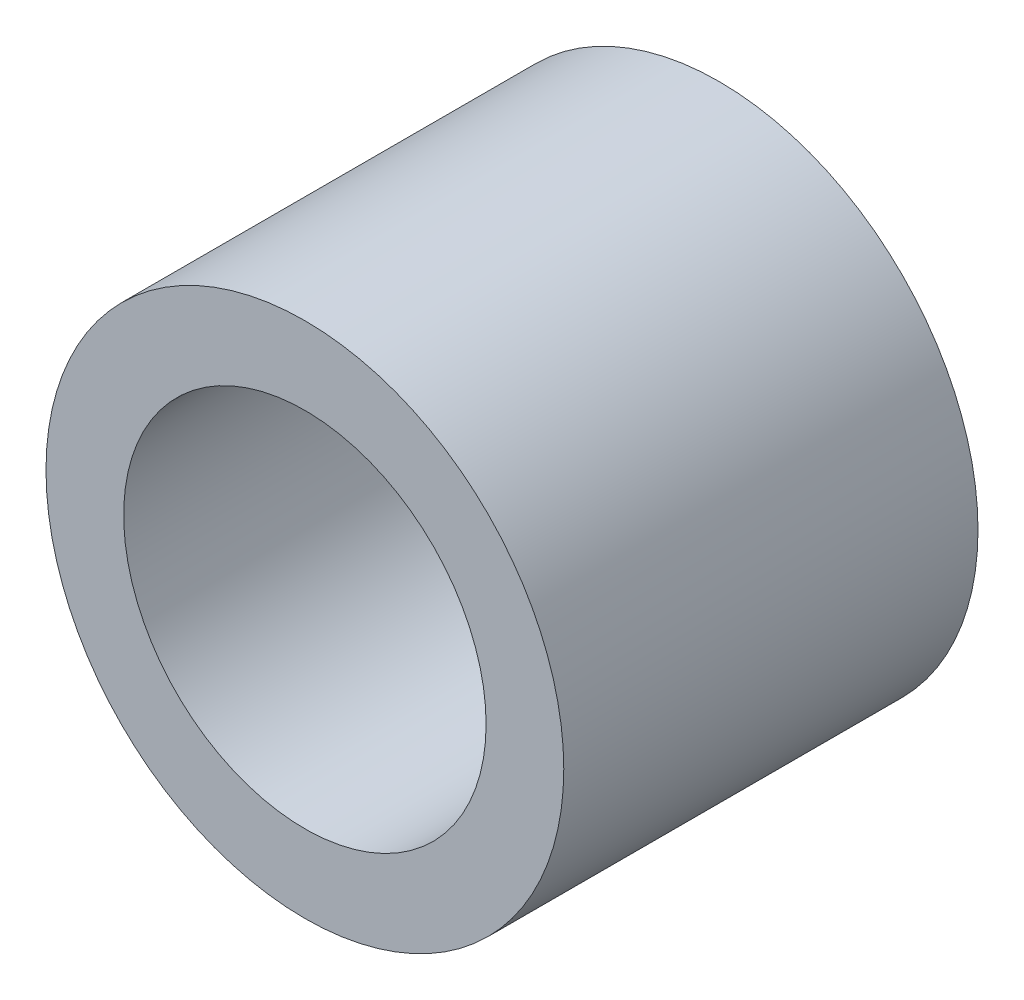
from build123d import *

# Parameters (mm, degrees)
SKETCH1_R          = 2.5
SKETCH1_R_2        = 1.75
BASE_EXTRUDE_DEPTH = 4


with BuildPart() as part:
    # Sketch1 → Base-Extrude (new body)
    with BuildSketch(Plane.XY):
        Circle(SKETCH1_R)
        Circle(SKETCH1_R_2, mode=Mode.SUBTRACT)
    extrude(amount=BASE_EXTRUDE_DEPTH)


solid = part.part
